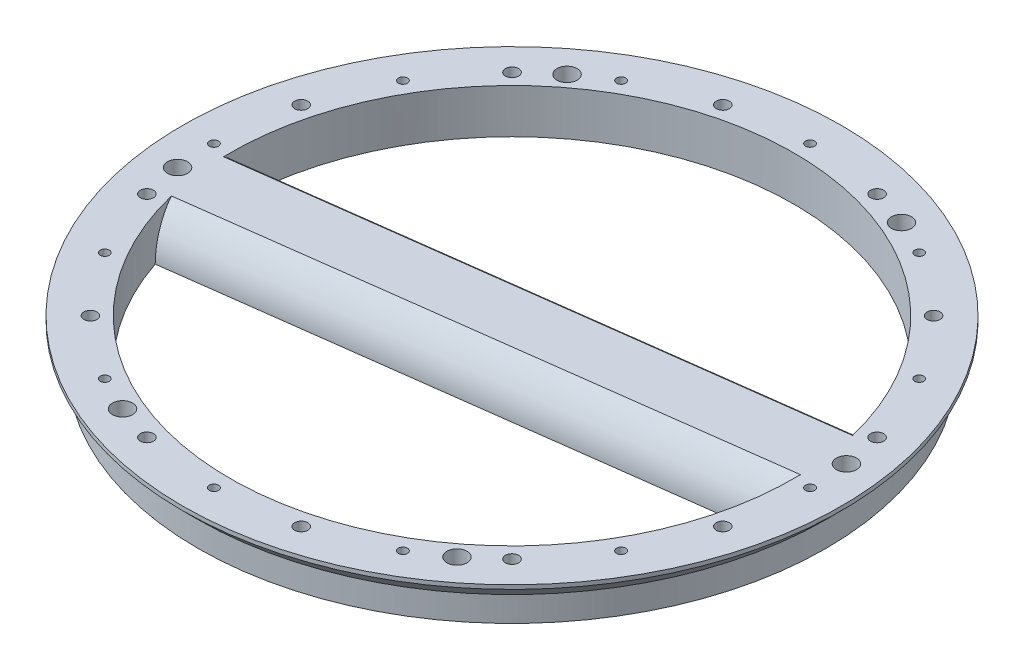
ISO-10303-21;
HEADER;
FILE_DESCRIPTION(('STEP AP214'),'2;1');
FILE_NAME('part.step','',(''),(''),'','','');
FILE_SCHEMA(('AUTOMOTIVE_DESIGN { 1 0 10303 214 1 1 1 1 }'));
ENDSEC;
DATA;
#1=APPLICATION_CONTEXT('core data for automotive mechanical design processes');
#2=APPLICATION_PROTOCOL_DEFINITION('international standard','automotive_design',2000,#1);
#3=PRODUCT_CONTEXT('',#1,'mechanical');
#4=PRODUCT('Part','Part','',(#3));
#5=PRODUCT_RELATED_PRODUCT_CATEGORY('part','',(#4));
#6=PRODUCT_DEFINITION_FORMATION('','',#4);
#7=PRODUCT_DEFINITION_CONTEXT('part definition',#1,'design');
#8=PRODUCT_DEFINITION('design','',#6,#7);
#9=PRODUCT_DEFINITION_SHAPE('','',#8);
#10=(LENGTH_UNIT() NAMED_UNIT(*) SI_UNIT(.MILLI.,.METRE.));
#11=(NAMED_UNIT(*) PLANE_ANGLE_UNIT() SI_UNIT($,.RADIAN.));
#12=(NAMED_UNIT(*) SI_UNIT($,.STERADIAN.) SOLID_ANGLE_UNIT());
#13=UNCERTAINTY_MEASURE_WITH_UNIT(LENGTH_MEASURE(1.E-05),#10,'distance_accuracy_value','');
#14=(GEOMETRIC_REPRESENTATION_CONTEXT(3) GLOBAL_UNCERTAINTY_ASSIGNED_CONTEXT((#13)) GLOBAL_UNIT_ASSIGNED_CONTEXT((#10,
#11,#12)) REPRESENTATION_CONTEXT('',''));
#15=CARTESIAN_POINT('',(0.,0.,0.));
#16=DIRECTION('',(0.,0.,1.));
#17=DIRECTION('',(1.,0.,0.));
#18=AXIS2_PLACEMENT_3D('',#15,#16,#17);
#19=CARTESIAN_POINT('',(0.,0.,0.));
#20=DIRECTION('',(0.,-1.,0.));
#21=DIRECTION('',(0.,0.,-1.));
#22=AXIS2_PLACEMENT_3D('',#19,#20,#21);
#23=CYLINDRICAL_SURFACE('',#22,69.9);
#24=CARTESIAN_POINT('',(0.,11.,0.));
#25=DIRECTION('',(0.,-1.,0.));
#26=DIRECTION('',(0.,0.,-1.));
#27=AXIS2_PLACEMENT_3D('',#24,#25,#26);
#28=CIRCLE('',#27,69.9);
#29=CARTESIAN_POINT('',(69.8808691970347,11.,-1.63527375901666));
#30=VERTEX_POINT('',#29);
#31=CARTESIAN_POINT('',(-67.9229763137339,11.,16.5069466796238));
#32=VERTEX_POINT('',#31);
#33=EDGE_CURVE('E98',#30,#32,#28,.T.);
#34=ORIENTED_EDGE('',*,*,#33,.F.);
#35=CARTESIAN_POINT('',(69.77111202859,0.,4.24286769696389));
#36=CARTESIAN_POINT('',(69.7710865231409,0.370943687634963,4.2429155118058));
#37=CARTESIAN_POINT('',(69.7720697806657,0.741876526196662,4.22710683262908));
#38=CARTESIAN_POINT('',(69.7758690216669,1.48102023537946,4.16412527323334));
#39=CARTESIAN_POINT('',(69.7786847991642,1.84923140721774,4.11695591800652));
#40=CARTESIAN_POINT('',(69.7859567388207,2.57955095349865,3.99173284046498));
#41=CARTESIAN_POINT('',(69.7904094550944,2.94167048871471,3.91374397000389));
#42=CARTESIAN_POINT('',(69.8006027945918,3.65803099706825,3.72754513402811));
#43=CARTESIAN_POINT('',(69.8063434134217,4.01227199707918,3.61933527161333));
#44=CARTESIAN_POINT('',(69.8186541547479,4.71054440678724,3.37352208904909));
#45=CARTESIAN_POINT('',(69.8252246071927,5.05457168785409,3.2359070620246));
#46=CARTESIAN_POINT('',(69.8386290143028,5.729913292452,2.93239834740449));
#47=CARTESIAN_POINT('',(69.8454629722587,6.06122745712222,2.76650430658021));
#48=CARTESIAN_POINT('',(69.8587524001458,6.70896084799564,2.40768231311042));
#49=CARTESIAN_POINT('',(69.8652077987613,7.0253772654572,2.21474928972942));
#50=CARTESIAN_POINT('',(69.8770375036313,7.64112895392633,1.80331963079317));
#51=CARTESIAN_POINT('',(69.8824118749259,7.94046525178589,1.58482453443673));
#52=CARTESIAN_POINT('',(69.8909900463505,8.49707654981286,1.14216153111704));
#53=CARTESIAN_POINT('',(69.8943322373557,8.75580438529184,0.919819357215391));
#54=CARTESIAN_POINT('',(69.8988960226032,9.25566367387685,0.456164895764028));
#55=CARTESIAN_POINT('',(69.900117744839,9.49679618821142,0.214853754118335));
#56=CARTESIAN_POINT('',(69.8998644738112,9.96015478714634,-0.285363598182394));
#57=CARTESIAN_POINT('',(69.89838899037,10.1823774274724,-0.544272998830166));
#58=CARTESIAN_POINT('',(69.8921965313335,10.6066429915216,-1.07813249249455));
#59=CARTESIAN_POINT('',(69.887479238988,10.8086839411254,-1.35308415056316));
#60=CARTESIAN_POINT('',(69.8808691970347,11.,-1.63527375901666));
#61=B_SPLINE_CURVE_WITH_KNOTS('',3,(#35,#36,#37,#38,#39,#40,#41,#42,#43,#44,#45,#46,#47,#48,#49,
#50,#51,#52,#53,#54,#55,#56,#57,#58,#59,#60),.UNSPECIFIED.,.F.,.F.,(4,2,2,2,2,2,2,2,2,2,2,2,4),
(0.,1.11247683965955,2.224828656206,3.33485216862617,4.44487189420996,5.55533437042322,
6.66581071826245,7.77649559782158,8.88711363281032,9.90960803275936,10.9320407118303,
11.9546592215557,12.9773776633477),.UNSPECIFIED.);
#62=CARTESIAN_POINT('',(69.77111202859,0.,4.24286769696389));
#63=VERTEX_POINT('',#62);
#64=EDGE_CURVE('E93',#63,#30,#61,.T.);
#65=ORIENTED_EDGE('',*,*,#64,.F.);
#66=CARTESIAN_POINT('',(0.,0.,0.));
#67=DIRECTION('',(0.,-1.,0.));
#68=DIRECTION('',(0.,0.,-1.));
#69=AXIS2_PLACEMENT_3D('',#66,#67,#68);
#70=CIRCLE('',#69,69.9);
#71=CARTESIAN_POINT('',(-66.2955840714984,0.,22.1563880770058));
#72=VERTEX_POINT('',#71);
#73=EDGE_CURVE('E79',#63,#72,#70,.T.);
#74=ORIENTED_EDGE('',*,*,#73,.T.);
#75=CARTESIAN_POINT('',(-66.2955840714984,0.,22.1563880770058));
#76=CARTESIAN_POINT('',(-66.2955470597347,0.370943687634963,22.1564276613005));
#77=CARTESIAN_POINT('',(-66.3005884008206,0.741876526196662,22.1414121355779));
#78=CARTESIAN_POINT('',(-66.3205590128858,1.48102023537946,22.0815599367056));
#79=CARTESIAN_POINT('',(-66.3354871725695,1.84923140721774,22.0367266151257));
#80=CARTESIAN_POINT('',(-66.374921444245,2.57955095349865,21.9176525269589));
#81=CARTESIAN_POINT('',(-66.3994074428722,2.94167048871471,21.8434735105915));
#82=CARTESIAN_POINT('',(-66.4574452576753,3.65803099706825,21.6662574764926));
#83=CARTESIAN_POINT('',(-66.4909970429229,4.01227199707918,21.5632205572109));
#84=CARTESIAN_POINT('',(-66.5665094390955,4.71054440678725,21.3289695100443));
#85=CARTESIAN_POINT('',(-66.6084733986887,5.0545716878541,21.1977441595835));
#86=CARTESIAN_POINT('',(-66.6999748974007,5.729913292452,20.9080465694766));
#87=CARTESIAN_POINT('',(-66.7495125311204,6.06122745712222,20.7495739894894));
#88=CARTESIAN_POINT('',(-66.8552190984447,6.70896084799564,20.4064181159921));
#89=CARTESIAN_POINT('',(-66.9113892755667,7.02537726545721,20.2217299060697));
#90=CARTESIAN_POINT('',(-67.0293017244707,7.64112895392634,19.8273811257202));
#91=CARTESIAN_POINT('',(-67.0910436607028,7.94046525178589,19.6177220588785));
#92=CARTESIAN_POINT('',(-67.2138991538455,8.49707654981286,19.1923626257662));
#93=CARTESIAN_POINT('',(-67.2746738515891,8.75580438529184,18.9784616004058));
#94=CARTESIAN_POINT('',(-67.3990847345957,9.25566367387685,18.5317869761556));
#95=CARTESIAN_POINT('',(-67.4627207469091,9.49679618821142,18.2990145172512));
#96=CARTESIAN_POINT('',(-67.5919418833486,9.96015478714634,17.8157761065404));
#97=CARTESIAN_POINT('',(-67.6575273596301,10.1823774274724,17.5653069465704));
#98=CARTESIAN_POINT('',(-67.7897189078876,10.6066429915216,17.0480355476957));
#99=CARTESIAN_POINT('',(-67.8563250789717,10.8086839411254,16.7812317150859));
#100=CARTESIAN_POINT('',(-67.9229763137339,11.,16.5069466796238));
#101=B_SPLINE_CURVE_WITH_KNOTS('',3,(#75,#76,#77,#78,#79,#80,#81,#82,#83,#84,#85,#86,#87,#88,
#89,#90,#91,#92,#93,#94,#95,#96,#97,#98,#99,#100),.UNSPECIFIED.,.F.,.F.,(4,2,2,2,2,2,2,2,2,2,2,
2,4),(0.,1.11247683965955,2.224828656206,3.33485216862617,4.44487189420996,5.55533437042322,
6.66581071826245,7.77649559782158,8.88711363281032,9.90960803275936,10.9320407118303,
11.9546592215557,12.9773776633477),.UNSPECIFIED.);
#102=EDGE_CURVE('E86',#72,#32,#101,.T.);
#103=ORIENTED_EDGE('',*,*,#102,.T.);
#104=EDGE_LOOP('',(#34,#65,#74,#103));
#105=FACE_BOUND('',#104,.T.);
#106=ADVANCED_FACE('F36',(#105),#23,.F.);
#107=CARTESIAN_POINT('',(-69.8808691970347,11.,1.63527375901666));
#108=VERTEX_POINT('',#107);
#109=CARTESIAN_POINT('',(67.9229763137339,11.,-16.5069466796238));
#110=VERTEX_POINT('',#109);
#111=EDGE_CURVE('E94',#108,#110,#28,.T.);
#112=ORIENTED_EDGE('',*,*,#111,.F.);
#113=CARTESIAN_POINT('',(-69.8808691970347,11.,1.63527375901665));
#114=CARTESIAN_POINT('',(-69.8881805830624,10.7884581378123,1.32323498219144));
#115=CARTESIAN_POINT('',(-69.8931746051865,10.5637931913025,1.02005404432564));
#116=CARTESIAN_POINT('',(-69.8992687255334,10.0899295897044,0.433489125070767));
#117=CARTESIAN_POINT('',(-69.9003689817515,9.84073193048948,0.150104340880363));
#118=CARTESIAN_POINT('',(-69.8994170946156,9.3196333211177,-0.394671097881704));
#119=CARTESIAN_POINT('',(-69.897366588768,9.04774423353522,-0.656073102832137));
#120=CARTESIAN_POINT('',(-69.8909000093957,8.48302928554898,-1.15514789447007));
#121=CARTESIAN_POINT('',(-69.8864839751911,8.19020377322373,-1.39282107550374));
#122=CARTESIAN_POINT('',(-69.8760654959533,7.58533935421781,-1.84288061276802));
#123=CARTESIAN_POINT('',(-69.8700616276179,7.27328340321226,-2.05524403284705));
#124=CARTESIAN_POINT('',(-69.8572348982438,6.63234472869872,-2.45281603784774));
#125=CARTESIAN_POINT('',(-69.8504120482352,6.3034622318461,-2.63802498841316));
#126=CARTESIAN_POINT('',(-69.8366697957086,5.63136898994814,-2.97972953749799));
#127=CARTESIAN_POINT('',(-69.8297504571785,5.28816746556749,-3.13624327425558));
#128=CARTESIAN_POINT('',(-69.8164567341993,4.5896779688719,-3.41942732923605));
#129=CARTESIAN_POINT('',(-69.8100822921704,4.23439127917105,-3.54610080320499));
#130=CARTESIAN_POINT('',(-69.7991885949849,3.56137957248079,-3.75401551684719));
#131=CARTESIAN_POINT('',(-69.7945357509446,3.24481656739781,-3.83903132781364));
#132=CARTESIAN_POINT('',(-69.7863425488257,2.60623496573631,-3.9851883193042));
#133=CARTESIAN_POINT('',(-69.7828020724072,2.28421695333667,-4.04633203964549));
#134=CARTESIAN_POINT('',(-69.7770486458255,1.63612555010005,-4.14439856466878));
#135=CARTESIAN_POINT('',(-69.7748372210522,1.31004793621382,-4.18129354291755));
#136=CARTESIAN_POINT('',(-69.7718609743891,0.65598281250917,-4.23054470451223));
#137=CARTESIAN_POINT('',(-69.7710964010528,0.327994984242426,-4.24289667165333));
#138=CARTESIAN_POINT('',(-69.77111202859,0.,-4.24286769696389));
#139=B_SPLINE_CURVE_WITH_KNOTS('',3,(#113,#114,#115,#116,#117,#118,#119,#120,#121,#122,#123,
#124,#125,#126,#127,#128,#129,#130,#131,#132,#133,#134,#135,#136,#137,#138),.UNSPECIFIED.,.F.,
.F.,(4,2,2,2,2,2,2,2,2,2,2,2,4),(0.,1.13081597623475,2.26158606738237,3.39176867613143,
4.52193249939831,5.65311283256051,6.78427793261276,7.91472553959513,9.04505354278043,
10.0276039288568,11.0100497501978,11.9936210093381,12.9773612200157),.UNSPECIFIED.);
#140=CARTESIAN_POINT('',(-69.77111202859,0.,-4.24286769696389));
#141=VERTEX_POINT('',#140);
#142=EDGE_CURVE('E91',#108,#141,#139,.T.);
#143=ORIENTED_EDGE('',*,*,#142,.T.);
#144=CARTESIAN_POINT('',(66.2955840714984,0.,-22.1563880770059));
#145=VERTEX_POINT('',#144);
#146=EDGE_CURVE('E95',#141,#145,#70,.T.);
#147=ORIENTED_EDGE('',*,*,#146,.T.);
#148=CARTESIAN_POINT('',(67.9229763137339,11.,-16.5069466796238));
#149=CARTESIAN_POINT('',(67.8492769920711,10.7884581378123,-16.810245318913));
#150=CARTESIAN_POINT('',(67.7756318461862,10.5637931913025,-17.1043881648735));
#151=CARTESIAN_POINT('',(67.6297041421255,10.0899295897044,-17.6725436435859));
#152=CARTESIAN_POINT('',(67.5574215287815,9.84073193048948,-17.9465570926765));
#153=CARTESIAN_POINT('',(67.4155038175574,9.3196333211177,-18.4725233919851));
#154=CARTESIAN_POINT('',(67.3458673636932,9.04774423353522,-18.7244876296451));
#155=CARTESIAN_POINT('',(67.2104510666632,8.48302928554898,-19.2048831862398));
#156=CARTESIAN_POINT('',(67.1446711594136,8.19020377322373,-19.4333148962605));
#157=CARTESIAN_POINT('',(67.0181237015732,7.5853393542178,-19.865342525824));
#158=CARTESIAN_POINT('',(66.9573607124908,7.27328340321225,-20.0689159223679));
#159=CARTESIAN_POINT('',(66.8420718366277,6.63234472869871,-20.4496211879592));
#160=CARTESIAN_POINT('',(66.7875458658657,6.30346223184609,-20.6267534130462));
#161=CARTESIAN_POINT('',(66.6858322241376,5.63136898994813,-20.9532579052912));
#162=CARTESIAN_POINT('',(66.6386399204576,5.28816746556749,-21.1026477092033));
#163=CARTESIAN_POINT('',(66.5525057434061,4.58967796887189,-21.3727418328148));
#164=CARTESIAN_POINT('',(66.5135629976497,4.23439127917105,-21.4934491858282));
#165=CARTESIAN_POINT('',(66.4492282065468,3.56137957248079,-21.6914598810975));
#166=CARTESIAN_POINT('',(66.4227301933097,3.24481656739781,-21.7723746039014));
#167=CARTESIAN_POINT('',(66.3769879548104,2.60623496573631,-21.9114308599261));
#168=CARTESIAN_POINT('',(66.3577429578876,2.28421695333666,-21.9695748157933));
#169=CARTESIAN_POINT('',(66.3268040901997,1.63612555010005,-22.0628107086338));
#170=CARTESIAN_POINT('',(66.3151188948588,1.31004793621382,-22.0978761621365));
#171=CARTESIAN_POINT('',(66.2994969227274,0.655982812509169,-22.1446788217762));
#172=CARTESIAN_POINT('',(66.2955614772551,0.327994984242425,-22.1564120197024));
#173=CARTESIAN_POINT('',(66.2955840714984,0.,-22.1563880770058));
#174=B_SPLINE_CURVE_WITH_KNOTS('',3,(#148,#149,#150,#151,#152,#153,#154,#155,#156,#157,#158,
#159,#160,#161,#162,#163,#164,#165,#166,#167,#168,#169,#170,#171,#172,#173),.UNSPECIFIED.,.F.,
.F.,(4,2,2,2,2,2,2,2,2,2,2,2,4),(0.,1.13081597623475,2.26158606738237,3.39176867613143,
4.52193249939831,5.65311283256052,6.78427793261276,7.91472553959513,9.04505354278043,
10.0276039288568,11.0100497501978,11.9936210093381,12.9773612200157),.UNSPECIFIED.);
#175=EDGE_CURVE('E273',#110,#145,#174,.T.);
#176=ORIENTED_EDGE('',*,*,#175,.F.);
#177=EDGE_LOOP('',(#112,#143,#147,#176));
#178=FACE_BOUND('',#177,.T.);
#179=ADVANCED_FACE('F129',(#178),#23,.F.);
#180=CARTESIAN_POINT('',(69.9,0.,0.));
#181=DIRECTION('',(0.,-1.,0.));
#182=DIRECTION('',(0.,0.,-1.));
#183=AXIS2_PLACEMENT_3D('',#180,#181,#182);
#184=PLANE('',#183);
#185=ORIENTED_EDGE('',*,*,#73,.F.);
#186=DIRECTION('',(-0.99144486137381,0.,0.130526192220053));
#187=VECTOR('',#186,1.);
#188=CARTESIAN_POINT('',(101.852395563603,0.,0.0192865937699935));
#189=LINE('',#188,#187);
#190=EDGE_CURVE('E75',#63,#72,#189,.T.);
#191=ORIENTED_EDGE('',*,*,#190,.T.);
#192=EDGE_LOOP('',(#185,#191));
#193=FACE_BOUND('',#192,.T.);
#194=CARTESIAN_POINT('',(73.2677752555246,0.,-9.64588560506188));
#195=DIRECTION('',(0.,-1.,0.));
#196=DIRECTION('',(0.,0.,-1.));
#197=AXIS2_PLACEMENT_3D('',#194,#195,#196);
#198=CIRCLE('',#197,2.5);
#199=CARTESIAN_POINT('',(73.2677752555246,0.,-12.1458856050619));
#200=VERTEX_POINT('',#199);
#201=EDGE_CURVE('E275',#200,#200,#198,.T.);
#202=ORIENTED_EDGE('',*,*,#201,.F.);
#203=EDGE_LOOP('',(#202));
#204=FACE_BOUND('',#203,.T.);
#205=CARTESIAN_POINT('',(44.9874696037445,0.,58.6288118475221));
#206=DIRECTION('',(0.,-1.,0.));
#207=DIRECTION('',(0.,0.,-1.));
#208=AXIS2_PLACEMENT_3D('',#205,#206,#207);
#209=CIRCLE('',#208,2.5);
#210=CARTESIAN_POINT('',(44.9874696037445,0.,56.1288118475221));
#211=VERTEX_POINT('',#210);
#212=EDGE_CURVE('E829',#211,#211,#209,.T.);
#213=ORIENTED_EDGE('',*,*,#212,.F.);
#214=EDGE_LOOP('',(#213));
#215=FACE_BOUND('',#214,.T.);
#216=CARTESIAN_POINT('',(-28.28030565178,0.,68.2746974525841));
#217=DIRECTION('',(0.,-1.,0.));
#218=DIRECTION('',(0.,0.,-1.));
#219=AXIS2_PLACEMENT_3D('',#216,#217,#218);
#220=CIRCLE('',#219,2.5);
#221=CARTESIAN_POINT('',(-28.28030565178,0.,65.7746974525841));
#222=VERTEX_POINT('',#221);
#223=EDGE_CURVE('E825',#222,#222,#220,.T.);
#224=ORIENTED_EDGE('',*,*,#223,.F.);
#225=EDGE_LOOP('',(#224));
#226=FACE_BOUND('',#225,.T.);
#227=CARTESIAN_POINT('',(-73.2677752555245,0.,9.64588560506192));
#228=DIRECTION('',(0.,-1.,0.));
#229=DIRECTION('',(0.,0.,-1.));
#230=AXIS2_PLACEMENT_3D('',#227,#228,#229);
#231=CIRCLE('',#230,2.5);
#232=CARTESIAN_POINT('',(-73.2677752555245,0.,7.14588560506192));
#233=VERTEX_POINT('',#232);
#234=EDGE_CURVE('E821',#233,#233,#231,.T.);
#235=ORIENTED_EDGE('',*,*,#234,.F.);
#236=EDGE_LOOP('',(#235));
#237=FACE_BOUND('',#236,.T.);
#238=CARTESIAN_POINT('',(-44.9874696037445,0.,-58.6288118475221));
#239=DIRECTION('',(0.,-1.,0.));
#240=DIRECTION('',(0.,0.,-1.));
#241=AXIS2_PLACEMENT_3D('',#238,#239,#240);
#242=CIRCLE('',#241,2.5);
#243=CARTESIAN_POINT('',(-44.9874696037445,0.,-61.1288118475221));
#244=VERTEX_POINT('',#243);
#245=EDGE_CURVE('E817',#244,#244,#242,.T.);
#246=ORIENTED_EDGE('',*,*,#245,.F.);
#247=EDGE_LOOP('',(#246));
#248=FACE_BOUND('',#247,.T.);
#249=CARTESIAN_POINT('',(28.28030565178,0.,-68.274697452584));
#250=DIRECTION('',(0.,-1.,0.));
#251=DIRECTION('',(0.,0.,-1.));
#252=AXIS2_PLACEMENT_3D('',#249,#250,#251);
#253=CIRCLE('',#252,2.5);
#254=CARTESIAN_POINT('',(28.28030565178,0.,-70.774697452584));
#255=VERTEX_POINT('',#254);
#256=EDGE_CURVE('E813',#255,#255,#253,.T.);
#257=ORIENTED_EDGE('',*,*,#256,.F.);
#258=EDGE_LOOP('',(#257));
#259=FACE_BOUND('',#258,.T.);
#260=CARTESIAN_POINT('',(71.3819185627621,0.,-19.1267274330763));
#261=DIRECTION('',(0.,-1.,0.));
#262=DIRECTION('',(0.,0.,-1.));
#263=AXIS2_PLACEMENT_3D('',#260,#261,#262);
#264=CIRCLE('',#263,1.63194999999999);
#265=CARTESIAN_POINT('',(71.3819185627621,0.,-20.7586774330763));
#266=VERTEX_POINT('',#265);
#267=EDGE_CURVE('E809',#266,#266,#264,.T.);
#268=ORIENTED_EDGE('',*,*,#267,.F.);
#269=EDGE_LOOP('',(#268));
#270=FACE_BOUND('',#269,.T.);
#271=CARTESIAN_POINT('',(71.3819185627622,0.,19.1267274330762));
#272=DIRECTION('',(0.,-1.,0.));
#273=DIRECTION('',(0.,0.,-1.));
#274=AXIS2_PLACEMENT_3D('',#271,#272,#273);
#275=CIRCLE('',#274,1.63194999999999);
#276=CARTESIAN_POINT('',(71.3819185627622,0.,17.4947774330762));
#277=VERTEX_POINT('',#276);
#278=EDGE_CURVE('E805',#277,#277,#275,.T.);
#279=ORIENTED_EDGE('',*,*,#278,.F.);
#280=EDGE_LOOP('',(#279));
#281=FACE_BOUND('',#280,.T.);
#282=CARTESIAN_POINT('',(52.255191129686,0.,52.2551911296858));
#283=DIRECTION('',(0.,-1.,0.));
#284=DIRECTION('',(0.,0.,-1.));
#285=AXIS2_PLACEMENT_3D('',#282,#283,#284);
#286=CIRCLE('',#285,1.63195);
#287=CARTESIAN_POINT('',(52.255191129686,0.,50.6232411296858));
#288=VERTEX_POINT('',#287);
#289=EDGE_CURVE('E801',#288,#288,#286,.T.);
#290=ORIENTED_EDGE('',*,*,#289,.F.);
#291=EDGE_LOOP('',(#290));
#292=FACE_BOUND('',#291,.T.);
#293=CARTESIAN_POINT('',(19.1267274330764,0.,71.3819185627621));
#294=DIRECTION('',(0.,-1.,0.));
#295=DIRECTION('',(0.,0.,-1.));
#296=AXIS2_PLACEMENT_3D('',#293,#294,#295);
#297=CIRCLE('',#296,1.63195);
#298=CARTESIAN_POINT('',(19.1267274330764,0.,69.7499685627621));
#299=VERTEX_POINT('',#298);
#300=EDGE_CURVE('E797',#299,#299,#297,.T.);
#301=ORIENTED_EDGE('',*,*,#300,.F.);
#302=EDGE_LOOP('',(#301));
#303=FACE_BOUND('',#302,.T.);
#304=CARTESIAN_POINT('',(-19.1267274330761,0.,71.3819185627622));
#305=DIRECTION('',(0.,-1.,0.));
#306=DIRECTION('',(0.,0.,-1.));
#307=AXIS2_PLACEMENT_3D('',#304,#305,#306);
#308=CIRCLE('',#307,1.63195);
#309=CARTESIAN_POINT('',(-19.1267274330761,0.,69.7499685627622));
#310=VERTEX_POINT('',#309);
#311=EDGE_CURVE('E793',#310,#310,#308,.T.);
#312=ORIENTED_EDGE('',*,*,#311,.F.);
#313=EDGE_LOOP('',(#312));
#314=FACE_BOUND('',#313,.T.);
#315=CARTESIAN_POINT('',(-52.2551911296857,0.,52.255191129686));
#316=DIRECTION('',(0.,-1.,0.));
#317=DIRECTION('',(0.,0.,-1.));
#318=AXIS2_PLACEMENT_3D('',#315,#316,#317);
#319=CIRCLE('',#318,1.63195);
#320=CARTESIAN_POINT('',(-52.2551911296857,0.,50.623241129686));
#321=VERTEX_POINT('',#320);
#322=EDGE_CURVE('E789',#321,#321,#319,.T.);
#323=ORIENTED_EDGE('',*,*,#322,.F.);
#324=EDGE_LOOP('',(#323));
#325=FACE_BOUND('',#324,.T.);
#326=CARTESIAN_POINT('',(-71.381918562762,0.,19.1267274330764));
#327=DIRECTION('',(0.,-1.,0.));
#328=DIRECTION('',(0.,0.,-1.));
#329=AXIS2_PLACEMENT_3D('',#326,#327,#328);
#330=CIRCLE('',#329,1.63194999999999);
#331=CARTESIAN_POINT('',(-71.381918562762,0.,17.4947774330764));
#332=VERTEX_POINT('',#331);
#333=EDGE_CURVE('E785',#332,#332,#330,.T.);
#334=ORIENTED_EDGE('',*,*,#333,.F.);
#335=EDGE_LOOP('',(#334));
#336=FACE_BOUND('',#335,.T.);
#337=CARTESIAN_POINT('',(-71.3819185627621,0.,-19.1267274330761));
#338=DIRECTION('',(0.,-1.,0.));
#339=DIRECTION('',(0.,0.,-1.));
#340=AXIS2_PLACEMENT_3D('',#337,#338,#339);
#341=CIRCLE('',#340,1.63194999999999);
#342=CARTESIAN_POINT('',(-71.3819185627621,0.,-20.7586774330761));
#343=VERTEX_POINT('',#342);
#344=EDGE_CURVE('E781',#343,#343,#341,.T.);
#345=ORIENTED_EDGE('',*,*,#344,.F.);
#346=EDGE_LOOP('',(#345));
#347=FACE_BOUND('',#346,.T.);
#348=CARTESIAN_POINT('',(-52.2551911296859,0.,-52.2551911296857));
#349=DIRECTION('',(0.,-1.,0.));
#350=DIRECTION('',(0.,0.,-1.));
#351=AXIS2_PLACEMENT_3D('',#348,#349,#350);
#352=CIRCLE('',#351,1.63195);
#353=CARTESIAN_POINT('',(-52.2551911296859,0.,-53.8871411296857));
#354=VERTEX_POINT('',#353);
#355=EDGE_CURVE('E777',#354,#354,#352,.T.);
#356=ORIENTED_EDGE('',*,*,#355,.F.);
#357=EDGE_LOOP('',(#356));
#358=FACE_BOUND('',#357,.T.);
#359=CARTESIAN_POINT('',(-19.1267274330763,0.,-71.3819185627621));
#360=DIRECTION('',(0.,-1.,0.));
#361=DIRECTION('',(0.,0.,-1.));
#362=AXIS2_PLACEMENT_3D('',#359,#360,#361);
#363=CIRCLE('',#362,1.63195);
#364=CARTESIAN_POINT('',(-19.1267274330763,0.,-73.0138685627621));
#365=VERTEX_POINT('',#364);
#366=EDGE_CURVE('E773',#365,#365,#363,.T.);
#367=ORIENTED_EDGE('',*,*,#366,.F.);
#368=EDGE_LOOP('',(#367));
#369=FACE_BOUND('',#368,.T.);
#370=CARTESIAN_POINT('',(19.1267274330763,0.,-71.3819185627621));
#371=DIRECTION('',(0.,-1.,0.));
#372=DIRECTION('',(0.,0.,-1.));
#373=AXIS2_PLACEMENT_3D('',#370,#371,#372);
#374=CIRCLE('',#373,1.63195);
#375=CARTESIAN_POINT('',(19.1267274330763,0.,-73.0138685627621));
#376=VERTEX_POINT('',#375);
#377=EDGE_CURVE('E769',#376,#376,#374,.T.);
#378=ORIENTED_EDGE('',*,*,#377,.F.);
#379=EDGE_LOOP('',(#378));
#380=FACE_BOUND('',#379,.T.);
#381=CARTESIAN_POINT('',(52.2551911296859,0.,-52.2551911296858));
#382=DIRECTION('',(0.,-1.,0.));
#383=DIRECTION('',(0.,0.,-1.));
#384=AXIS2_PLACEMENT_3D('',#381,#382,#383);
#385=CIRCLE('',#384,1.63195);
#386=CARTESIAN_POINT('',(52.2551911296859,0.,-53.8871411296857));
#387=VERTEX_POINT('',#386);
#388=EDGE_CURVE('E765',#387,#387,#385,.T.);
#389=ORIENTED_EDGE('',*,*,#388,.F.);
#390=EDGE_LOOP('',(#389));
#391=FACE_BOUND('',#390,.T.);
#392=CARTESIAN_POINT('',(73.9,0.,0.));
#393=DIRECTION('',(0.,-1.,0.));
#394=DIRECTION('',(0.,0.,-1.));
#395=AXIS2_PLACEMENT_3D('',#392,#393,#394);
#396=CIRCLE('',#395,1.13029999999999);
#397=CARTESIAN_POINT('',(73.9,0.,-1.13029999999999));
#398=VERTEX_POINT('',#397);
#399=EDGE_CURVE('E761',#398,#398,#396,.T.);
#400=ORIENTED_EDGE('',*,*,#399,.F.);
#401=EDGE_LOOP('',(#400));
#402=FACE_BOUND('',#401,.T.);
#403=CARTESIAN_POINT('',(63.9992773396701,0.,36.95));
#404=DIRECTION('',(0.,-1.,0.));
#405=DIRECTION('',(0.,0.,-1.));
#406=AXIS2_PLACEMENT_3D('',#403,#404,#405);
#407=CIRCLE('',#406,1.13029999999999);
#408=CARTESIAN_POINT('',(63.9992773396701,0.,35.8197));
#409=VERTEX_POINT('',#408);
#410=EDGE_CURVE('E757',#409,#409,#407,.T.);
#411=ORIENTED_EDGE('',*,*,#410,.F.);
#412=EDGE_LOOP('',(#411));
#413=FACE_BOUND('',#412,.T.);
#414=CARTESIAN_POINT('',(36.95,0.,63.99927733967));
#415=DIRECTION('',(0.,-1.,0.));
#416=DIRECTION('',(0.,0.,-1.));
#417=AXIS2_PLACEMENT_3D('',#414,#415,#416);
#418=CIRCLE('',#417,1.13029999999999);
#419=CARTESIAN_POINT('',(36.95,0.,62.86897733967));
#420=VERTEX_POINT('',#419);
#421=EDGE_CURVE('E753',#420,#420,#418,.T.);
#422=ORIENTED_EDGE('',*,*,#421,.F.);
#423=EDGE_LOOP('',(#422));
#424=FACE_BOUND('',#423,.T.);
#425=CARTESIAN_POINT('',(0.,0.,73.9));
#426=DIRECTION('',(0.,-1.,0.));
#427=DIRECTION('',(0.,0.,-1.));
#428=AXIS2_PLACEMENT_3D('',#425,#426,#427);
#429=CIRCLE('',#428,1.13029999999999);
#430=CARTESIAN_POINT('',(0.,0.,72.7697));
#431=VERTEX_POINT('',#430);
#432=EDGE_CURVE('E749',#431,#431,#429,.T.);
#433=ORIENTED_EDGE('',*,*,#432,.F.);
#434=EDGE_LOOP('',(#433));
#435=FACE_BOUND('',#434,.T.);
#436=CARTESIAN_POINT('',(-36.9499999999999,0.,63.9992773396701));
#437=DIRECTION('',(0.,-1.,0.));
#438=DIRECTION('',(0.,0.,-1.));
#439=AXIS2_PLACEMENT_3D('',#436,#437,#438);
#440=CIRCLE('',#439,1.13029999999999);
#441=CARTESIAN_POINT('',(-36.9499999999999,0.,62.8689773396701));
#442=VERTEX_POINT('',#441);
#443=EDGE_CURVE('E745',#442,#442,#440,.T.);
#444=ORIENTED_EDGE('',*,*,#443,.F.);
#445=EDGE_LOOP('',(#444));
#446=FACE_BOUND('',#445,.T.);
#447=CARTESIAN_POINT('',(-63.99927733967,0.,36.9500000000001));
#448=DIRECTION('',(0.,-1.,0.));
#449=DIRECTION('',(0.,0.,-1.));
#450=AXIS2_PLACEMENT_3D('',#447,#448,#449);
#451=CIRCLE('',#450,1.13029999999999);
#452=CARTESIAN_POINT('',(-63.99927733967,0.,35.8197000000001));
#453=VERTEX_POINT('',#452);
#454=EDGE_CURVE('E741',#453,#453,#451,.T.);
#455=ORIENTED_EDGE('',*,*,#454,.F.);
#456=EDGE_LOOP('',(#455));
#457=FACE_BOUND('',#456,.T.);
#458=CARTESIAN_POINT('',(-73.9,0.,0.));
#459=DIRECTION('',(0.,-1.,0.));
#460=DIRECTION('',(0.,0.,-1.));
#461=AXIS2_PLACEMENT_3D('',#458,#459,#460);
#462=CIRCLE('',#461,1.13029999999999);
#463=CARTESIAN_POINT('',(-73.9,0.,-1.1302999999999));
#464=VERTEX_POINT('',#463);
#465=EDGE_CURVE('E737',#464,#464,#462,.T.);
#466=ORIENTED_EDGE('',*,*,#465,.F.);
#467=EDGE_LOOP('',(#466));
#468=FACE_BOUND('',#467,.T.);
#469=CARTESIAN_POINT('',(-63.99927733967,0.,-36.9499999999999));
#470=DIRECTION('',(0.,-1.,0.));
#471=DIRECTION('',(0.,0.,-1.));
#472=AXIS2_PLACEMENT_3D('',#469,#470,#471);
#473=CIRCLE('',#472,1.13029999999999);
#474=CARTESIAN_POINT('',(-63.99927733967,0.,-38.0802999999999));
#475=VERTEX_POINT('',#474);
#476=EDGE_CURVE('E733',#475,#475,#473,.T.);
#477=ORIENTED_EDGE('',*,*,#476,.F.);
#478=EDGE_LOOP('',(#477));
#479=FACE_BOUND('',#478,.T.);
#480=CARTESIAN_POINT('',(-36.95,0.,-63.9992773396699));
#481=DIRECTION('',(0.,-1.,0.));
#482=DIRECTION('',(0.,0.,-1.));
#483=AXIS2_PLACEMENT_3D('',#480,#481,#482);
#484=CIRCLE('',#483,1.13029999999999);
#485=CARTESIAN_POINT('',(-36.95,0.,-65.1295773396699));
#486=VERTEX_POINT('',#485);
#487=EDGE_CURVE('E729',#486,#486,#484,.T.);
#488=ORIENTED_EDGE('',*,*,#487,.F.);
#489=EDGE_LOOP('',(#488));
#490=FACE_BOUND('',#489,.T.);
#491=CARTESIAN_POINT('',(0.,0.,-73.8999999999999));
#492=DIRECTION('',(0.,-1.,0.));
#493=DIRECTION('',(0.,0.,-1.));
#494=AXIS2_PLACEMENT_3D('',#491,#492,#493);
#495=CIRCLE('',#494,1.13029999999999);
#496=CARTESIAN_POINT('',(0.,0.,-75.0302999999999));
#497=VERTEX_POINT('',#496);
#498=EDGE_CURVE('E426',#497,#497,#495,.T.);
#499=ORIENTED_EDGE('',*,*,#498,.F.);
#500=EDGE_LOOP('',(#499));
#501=FACE_BOUND('',#500,.T.);
#502=CARTESIAN_POINT('',(36.9499999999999,0.,-63.99927733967));
#503=DIRECTION('',(0.,-1.,0.));
#504=DIRECTION('',(0.,0.,-1.));
#505=AXIS2_PLACEMENT_3D('',#502,#503,#504);
#506=CIRCLE('',#505,1.13029999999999);
#507=CARTESIAN_POINT('',(36.9499999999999,0.,-65.12957733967));
#508=VERTEX_POINT('',#507);
#509=EDGE_CURVE('E425',#508,#508,#506,.T.);
#510=ORIENTED_EDGE('',*,*,#509,.F.);
#511=EDGE_LOOP('',(#510));
#512=FACE_BOUND('',#511,.T.);
#513=CARTESIAN_POINT('',(63.99927733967,0.,-36.95));
#514=DIRECTION('',(0.,-1.,0.));
#515=DIRECTION('',(0.,0.,-1.));
#516=AXIS2_PLACEMENT_3D('',#513,#514,#515);
#517=CIRCLE('',#516,1.13029999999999);
#518=CARTESIAN_POINT('',(63.99927733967,0.,-38.0803));
#519=VERTEX_POINT('',#518);
#520=EDGE_CURVE('E101',#519,#519,#517,.T.);
#521=ORIENTED_EDGE('',*,*,#520,.F.);
#522=EDGE_LOOP('',(#521));
#523=FACE_BOUND('',#522,.T.);
#524=CARTESIAN_POINT('',(0.,0.,0.));
#525=DIRECTION('',(0.,-1.,0.));
#526=DIRECTION('',(0.,0.,-1.));
#527=AXIS2_PLACEMENT_3D('',#524,#525,#526);
#528=CIRCLE('',#527,77.9);
#529=CARTESIAN_POINT('',(0.,0.,-77.9));
#530=VERTEX_POINT('',#529);
#531=EDGE_CURVE('E11',#530,#530,#528,.T.);
#532=ORIENTED_EDGE('',*,*,#531,.T.);
#533=EDGE_LOOP('',(#532));
#534=FACE_BOUND('',#533,.T.);
#535=DIRECTION('',(-0.99144486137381,0.,0.130526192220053));
#536=VECTOR('',#535,1.);
#537=CARTESIAN_POINT('',(98.3768676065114,0.,-26.3799691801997));
#538=LINE('',#537,#536);
#539=EDGE_CURVE('E56',#145,#141,#538,.T.);
#540=ORIENTED_EDGE('',*,*,#539,.F.);
#541=ORIENTED_EDGE('',*,*,#146,.F.);
#542=EDGE_LOOP('',(#540,#541));
#543=FACE_BOUND('',#542,.T.);
#544=ADVANCED_FACE('F38',(#193,#204,#215,#226,#237,#248,#259,#270,#281,#292,#303,#314,#325,#336,
#347,#358,#369,#380,#391,#402,#413,#424,#435,#446,#457,#468,#479,#490,#501,#512,#523,#534,#543),
#184,.T.);
#545=CARTESIAN_POINT('',(0.,0.,0.));
#546=DIRECTION('',(0.,-1.,0.));
#547=DIRECTION('',(0.,0.,-1.));
#548=AXIS2_PLACEMENT_3D('',#545,#546,#547);
#549=CYLINDRICAL_SURFACE('',#548,77.9);
#550=CARTESIAN_POINT('',(0.,6.20000000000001,0.));
#551=DIRECTION('',(0.,-1.,0.));
#552=DIRECTION('',(0.,0.,-1.));
#553=AXIS2_PLACEMENT_3D('',#550,#551,#552);
#554=CIRCLE('',#553,77.9);
#555=CARTESIAN_POINT('',(0.,6.20000000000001,-77.9));
#556=VERTEX_POINT('',#555);
#557=EDGE_CURVE('E44',#556,#556,#554,.T.);
#558=ORIENTED_EDGE('',*,*,#557,.T.);
#559=EDGE_LOOP('',(#558));
#560=FACE_BOUND('',#559,.T.);
#561=ORIENTED_EDGE('',*,*,#531,.F.);
#562=EDGE_LOOP('',(#561));
#563=FACE_BOUND('',#562,.T.);
#564=ADVANCED_FACE('F113',(#560,#563),#549,.T.);
#565=CARTESIAN_POINT('',(0.,6.20000000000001,0.));
#566=DIRECTION('',(0.,1.,0.));
#567=DIRECTION('',(0.,0.,1.));
#568=AXIS2_PLACEMENT_3D('',#565,#566,#567);
#569=CONICAL_SURFACE('',#568,77.9,0.78539816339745);
#570=CARTESIAN_POINT('',(0.,10.,0.));
#571=DIRECTION('',(0.,-1.,0.));
#572=DIRECTION('',(0.,0.,-1.));
#573=AXIS2_PLACEMENT_3D('',#570,#571,#572);
#574=CIRCLE('',#573,81.7);
#575=CARTESIAN_POINT('',(0.,10.,-81.7));
#576=VERTEX_POINT('',#575);
#577=EDGE_CURVE('E108',#576,#576,#574,.T.);
#578=ORIENTED_EDGE('',*,*,#577,.T.);
#579=EDGE_LOOP('',(#578));
#580=FACE_BOUND('',#579,.T.);
#581=ORIENTED_EDGE('',*,*,#557,.F.);
#582=EDGE_LOOP('',(#581));
#583=FACE_BOUND('',#582,.T.);
#584=ADVANCED_FACE('F116',(#580,#583),#569,.T.);
#585=CARTESIAN_POINT('',(0.,0.,0.));
#586=DIRECTION('',(0.,-1.,0.));
#587=DIRECTION('',(0.,0.,-1.));
#588=AXIS2_PLACEMENT_3D('',#585,#586,#587);
#589=CYLINDRICAL_SURFACE('',#588,81.7);
#590=CARTESIAN_POINT('',(0.,11.,0.));
#591=DIRECTION('',(0.,-1.,0.));
#592=DIRECTION('',(0.,0.,-1.));
#593=AXIS2_PLACEMENT_3D('',#590,#591,#592);
#594=CIRCLE('',#593,81.7);
#595=CARTESIAN_POINT('',(0.,11.,-81.7));
#596=VERTEX_POINT('',#595);
#597=EDGE_CURVE('E105',#596,#596,#594,.T.);
#598=ORIENTED_EDGE('',*,*,#597,.T.);
#599=EDGE_LOOP('',(#598));
#600=FACE_BOUND('',#599,.T.);
#601=ORIENTED_EDGE('',*,*,#577,.F.);
#602=EDGE_LOOP('',(#601));
#603=FACE_BOUND('',#602,.T.);
#604=ADVANCED_FACE('F118',(#600,#603),#589,.T.);
#605=CARTESIAN_POINT('',(81.7,11.,0.));
#606=DIRECTION('',(0.,1.,0.));
#607=DIRECTION('',(0.,0.,1.));
#608=AXIS2_PLACEMENT_3D('',#605,#606,#607);
#609=PLANE('',#608);
#610=DIRECTION('',(-0.99144486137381,0.,0.130526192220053));
#611=VECTOR('',#610,1.);
#612=CARTESIAN_POINT('',(101.093578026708,11.,-5.7445048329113));
#613=LINE('',#612,#611);
#614=EDGE_CURVE('E83',#30,#32,#613,.T.);
#615=ORIENTED_EDGE('',*,*,#614,.F.);
#616=ORIENTED_EDGE('',*,*,#33,.T.);
#617=EDGE_LOOP('',(#615,#616));
#618=FACE_BOUND('',#617,.T.);
#619=CARTESIAN_POINT('',(73.2677752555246,11.,-9.64588560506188));
#620=DIRECTION('',(0.,1.,0.));
#621=DIRECTION('',(0.,0.,1.));
#622=AXIS2_PLACEMENT_3D('',#619,#620,#621);
#623=CIRCLE('',#622,2.5);
#624=CARTESIAN_POINT('',(73.2677752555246,11.,-7.14588560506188));
#625=VERTEX_POINT('',#624);
#626=EDGE_CURVE('E150',#625,#625,#623,.T.);
#627=ORIENTED_EDGE('',*,*,#626,.F.);
#628=EDGE_LOOP('',(#627));
#629=FACE_BOUND('',#628,.T.);
#630=CARTESIAN_POINT('',(44.9874696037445,11.,58.6288118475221));
#631=DIRECTION('',(0.,1.,0.));
#632=DIRECTION('',(0.,0.,1.));
#633=AXIS2_PLACEMENT_3D('',#630,#631,#632);
#634=CIRCLE('',#633,2.5);
#635=CARTESIAN_POINT('',(44.9874696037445,11.,61.1288118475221));
#636=VERTEX_POINT('',#635);
#637=EDGE_CURVE('E154',#636,#636,#634,.T.);
#638=ORIENTED_EDGE('',*,*,#637,.F.);
#639=EDGE_LOOP('',(#638));
#640=FACE_BOUND('',#639,.T.);
#641=CARTESIAN_POINT('',(-28.28030565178,11.,68.2746974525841));
#642=DIRECTION('',(0.,1.,0.));
#643=DIRECTION('',(0.,0.,1.));
#644=AXIS2_PLACEMENT_3D('',#641,#642,#643);
#645=CIRCLE('',#644,2.5);
#646=CARTESIAN_POINT('',(-28.28030565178,11.,70.7746974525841));
#647=VERTEX_POINT('',#646);
#648=EDGE_CURVE('E158',#647,#647,#645,.T.);
#649=ORIENTED_EDGE('',*,*,#648,.F.);
#650=EDGE_LOOP('',(#649));
#651=FACE_BOUND('',#650,.T.);
#652=CARTESIAN_POINT('',(-73.2677752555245,11.,9.64588560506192));
#653=DIRECTION('',(0.,1.,0.));
#654=DIRECTION('',(0.,0.,1.));
#655=AXIS2_PLACEMENT_3D('',#652,#653,#654);
#656=CIRCLE('',#655,2.5);
#657=CARTESIAN_POINT('',(-73.2677752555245,11.,12.1458856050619));
#658=VERTEX_POINT('',#657);
#659=EDGE_CURVE('E162',#658,#658,#656,.T.);
#660=ORIENTED_EDGE('',*,*,#659,.F.);
#661=EDGE_LOOP('',(#660));
#662=FACE_BOUND('',#661,.T.);
#663=CARTESIAN_POINT('',(-44.9874696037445,11.,-58.6288118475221));
#664=DIRECTION('',(0.,1.,0.));
#665=DIRECTION('',(0.,0.,1.));
#666=AXIS2_PLACEMENT_3D('',#663,#664,#665);
#667=CIRCLE('',#666,2.5);
#668=CARTESIAN_POINT('',(-44.9874696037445,11.,-56.1288118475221));
#669=VERTEX_POINT('',#668);
#670=EDGE_CURVE('E166',#669,#669,#667,.T.);
#671=ORIENTED_EDGE('',*,*,#670,.F.);
#672=EDGE_LOOP('',(#671));
#673=FACE_BOUND('',#672,.T.);
#674=CARTESIAN_POINT('',(28.28030565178,11.,-68.274697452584));
#675=DIRECTION('',(0.,1.,0.));
#676=DIRECTION('',(0.,0.,1.));
#677=AXIS2_PLACEMENT_3D('',#674,#675,#676);
#678=CIRCLE('',#677,2.5);
#679=CARTESIAN_POINT('',(28.28030565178,11.,-65.774697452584));
#680=VERTEX_POINT('',#679);
#681=EDGE_CURVE('E170',#680,#680,#678,.T.);
#682=ORIENTED_EDGE('',*,*,#681,.F.);
#683=EDGE_LOOP('',(#682));
#684=FACE_BOUND('',#683,.T.);
#685=CARTESIAN_POINT('',(71.3819185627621,11.,-19.1267274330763));
#686=DIRECTION('',(0.,1.,0.));
#687=DIRECTION('',(0.,0.,1.));
#688=AXIS2_PLACEMENT_3D('',#685,#686,#687);
#689=CIRCLE('',#688,1.63194999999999);
#690=CARTESIAN_POINT('',(71.3819185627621,11.,-17.4947774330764));
#691=VERTEX_POINT('',#690);
#692=EDGE_CURVE('E174',#691,#691,#689,.T.);
#693=ORIENTED_EDGE('',*,*,#692,.F.);
#694=EDGE_LOOP('',(#693));
#695=FACE_BOUND('',#694,.T.);
#696=CARTESIAN_POINT('',(71.3819185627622,11.,19.1267274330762));
#697=DIRECTION('',(0.,1.,0.));
#698=DIRECTION('',(0.,0.,1.));
#699=AXIS2_PLACEMENT_3D('',#696,#697,#698);
#700=CIRCLE('',#699,1.63194999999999);
#701=CARTESIAN_POINT('',(71.3819185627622,11.,20.7586774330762));
#702=VERTEX_POINT('',#701);
#703=EDGE_CURVE('E178',#702,#702,#700,.T.);
#704=ORIENTED_EDGE('',*,*,#703,.F.);
#705=EDGE_LOOP('',(#704));
#706=FACE_BOUND('',#705,.T.);
#707=CARTESIAN_POINT('',(52.255191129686,11.,52.2551911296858));
#708=DIRECTION('',(0.,1.,0.));
#709=DIRECTION('',(0.,0.,1.));
#710=AXIS2_PLACEMENT_3D('',#707,#708,#709);
#711=CIRCLE('',#710,1.63195);
#712=CARTESIAN_POINT('',(52.255191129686,11.,53.8871411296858));
#713=VERTEX_POINT('',#712);
#714=EDGE_CURVE('E182',#713,#713,#711,.T.);
#715=ORIENTED_EDGE('',*,*,#714,.F.);
#716=EDGE_LOOP('',(#715));
#717=FACE_BOUND('',#716,.T.);
#718=CARTESIAN_POINT('',(19.1267274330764,11.,71.3819185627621));
#719=DIRECTION('',(0.,1.,0.));
#720=DIRECTION('',(0.,0.,1.));
#721=AXIS2_PLACEMENT_3D('',#718,#719,#720);
#722=CIRCLE('',#721,1.63195);
#723=CARTESIAN_POINT('',(19.1267274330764,11.,73.0138685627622));
#724=VERTEX_POINT('',#723);
#725=EDGE_CURVE('E186',#724,#724,#722,.T.);
#726=ORIENTED_EDGE('',*,*,#725,.F.);
#727=EDGE_LOOP('',(#726));
#728=FACE_BOUND('',#727,.T.);
#729=CARTESIAN_POINT('',(-19.1267274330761,11.,71.3819185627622));
#730=DIRECTION('',(0.,1.,0.));
#731=DIRECTION('',(0.,0.,1.));
#732=AXIS2_PLACEMENT_3D('',#729,#730,#731);
#733=CIRCLE('',#732,1.63195);
#734=CARTESIAN_POINT('',(-19.1267274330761,11.,73.0138685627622));
#735=VERTEX_POINT('',#734);
#736=EDGE_CURVE('E190',#735,#735,#733,.T.);
#737=ORIENTED_EDGE('',*,*,#736,.F.);
#738=EDGE_LOOP('',(#737));
#739=FACE_BOUND('',#738,.T.);
#740=CARTESIAN_POINT('',(-52.2551911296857,11.,52.255191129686));
#741=DIRECTION('',(0.,1.,0.));
#742=DIRECTION('',(0.,0.,1.));
#743=AXIS2_PLACEMENT_3D('',#740,#741,#742);
#744=CIRCLE('',#743,1.63195);
#745=CARTESIAN_POINT('',(-52.2551911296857,11.,53.887141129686));
#746=VERTEX_POINT('',#745);
#747=EDGE_CURVE('E194',#746,#746,#744,.T.);
#748=ORIENTED_EDGE('',*,*,#747,.F.);
#749=EDGE_LOOP('',(#748));
#750=FACE_BOUND('',#749,.T.);
#751=CARTESIAN_POINT('',(-71.381918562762,11.,19.1267274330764));
#752=DIRECTION('',(0.,1.,0.));
#753=DIRECTION('',(0.,0.,1.));
#754=AXIS2_PLACEMENT_3D('',#751,#752,#753);
#755=CIRCLE('',#754,1.63194999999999);
#756=CARTESIAN_POINT('',(-71.381918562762,11.,20.7586774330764));
#757=VERTEX_POINT('',#756);
#758=EDGE_CURVE('E198',#757,#757,#755,.T.);
#759=ORIENTED_EDGE('',*,*,#758,.F.);
#760=EDGE_LOOP('',(#759));
#761=FACE_BOUND('',#760,.T.);
#762=CARTESIAN_POINT('',(-71.3819185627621,11.,-19.1267274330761));
#763=DIRECTION('',(0.,1.,0.));
#764=DIRECTION('',(0.,0.,1.));
#765=AXIS2_PLACEMENT_3D('',#762,#763,#764);
#766=CIRCLE('',#765,1.63194999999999);
#767=CARTESIAN_POINT('',(-71.3819185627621,11.,-17.4947774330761));
#768=VERTEX_POINT('',#767);
#769=EDGE_CURVE('E202',#768,#768,#766,.T.);
#770=ORIENTED_EDGE('',*,*,#769,.F.);
#771=EDGE_LOOP('',(#770));
#772=FACE_BOUND('',#771,.T.);
#773=CARTESIAN_POINT('',(-52.2551911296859,11.,-52.2551911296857));
#774=DIRECTION('',(0.,1.,0.));
#775=DIRECTION('',(0.,0.,1.));
#776=AXIS2_PLACEMENT_3D('',#773,#774,#775);
#777=CIRCLE('',#776,1.63195);
#778=CARTESIAN_POINT('',(-52.2551911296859,11.,-50.6232411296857));
#779=VERTEX_POINT('',#778);
#780=EDGE_CURVE('E206',#779,#779,#777,.T.);
#781=ORIENTED_EDGE('',*,*,#780,.F.);
#782=EDGE_LOOP('',(#781));
#783=FACE_BOUND('',#782,.T.);
#784=CARTESIAN_POINT('',(-19.1267274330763,11.,-71.3819185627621));
#785=DIRECTION('',(0.,1.,0.));
#786=DIRECTION('',(0.,0.,1.));
#787=AXIS2_PLACEMENT_3D('',#784,#785,#786);
#788=CIRCLE('',#787,1.63195);
#789=CARTESIAN_POINT('',(-19.1267274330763,11.,-69.7499685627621));
#790=VERTEX_POINT('',#789);
#791=EDGE_CURVE('E210',#790,#790,#788,.T.);
#792=ORIENTED_EDGE('',*,*,#791,.F.);
#793=EDGE_LOOP('',(#792));
#794=FACE_BOUND('',#793,.T.);
#795=CARTESIAN_POINT('',(19.1267274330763,11.,-71.3819185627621));
#796=DIRECTION('',(0.,1.,0.));
#797=DIRECTION('',(0.,0.,1.));
#798=AXIS2_PLACEMENT_3D('',#795,#796,#797);
#799=CIRCLE('',#798,1.63195);
#800=CARTESIAN_POINT('',(19.1267274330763,11.,-69.7499685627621));
#801=VERTEX_POINT('',#800);
#802=EDGE_CURVE('E214',#801,#801,#799,.T.);
#803=ORIENTED_EDGE('',*,*,#802,.F.);
#804=EDGE_LOOP('',(#803));
#805=FACE_BOUND('',#804,.T.);
#806=CARTESIAN_POINT('',(52.2551911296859,11.,-52.2551911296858));
#807=DIRECTION('',(0.,1.,0.));
#808=DIRECTION('',(0.,0.,1.));
#809=AXIS2_PLACEMENT_3D('',#806,#807,#808);
#810=CIRCLE('',#809,1.63195);
#811=CARTESIAN_POINT('',(52.2551911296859,11.,-50.6232411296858));
#812=VERTEX_POINT('',#811);
#813=EDGE_CURVE('E218',#812,#812,#810,.T.);
#814=ORIENTED_EDGE('',*,*,#813,.F.);
#815=EDGE_LOOP('',(#814));
#816=FACE_BOUND('',#815,.T.);
#817=CARTESIAN_POINT('',(73.9,11.,0.));
#818=DIRECTION('',(0.,1.,0.));
#819=DIRECTION('',(0.,0.,1.));
#820=AXIS2_PLACEMENT_3D('',#817,#818,#819);
#821=CIRCLE('',#820,1.13029999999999);
#822=CARTESIAN_POINT('',(73.9,11.,1.13029999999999));
#823=VERTEX_POINT('',#822);
#824=EDGE_CURVE('E222',#823,#823,#821,.T.);
#825=ORIENTED_EDGE('',*,*,#824,.F.);
#826=EDGE_LOOP('',(#825));
#827=FACE_BOUND('',#826,.T.);
#828=CARTESIAN_POINT('',(63.9992773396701,11.,36.95));
#829=DIRECTION('',(0.,1.,0.));
#830=DIRECTION('',(0.,0.,1.));
#831=AXIS2_PLACEMENT_3D('',#828,#829,#830);
#832=CIRCLE('',#831,1.13029999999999);
#833=CARTESIAN_POINT('',(63.9992773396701,11.,38.0803));
#834=VERTEX_POINT('',#833);
#835=EDGE_CURVE('E226',#834,#834,#832,.T.);
#836=ORIENTED_EDGE('',*,*,#835,.F.);
#837=EDGE_LOOP('',(#836));
#838=FACE_BOUND('',#837,.T.);
#839=CARTESIAN_POINT('',(36.95,11.,63.99927733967));
#840=DIRECTION('',(0.,1.,0.));
#841=DIRECTION('',(0.,0.,1.));
#842=AXIS2_PLACEMENT_3D('',#839,#840,#841);
#843=CIRCLE('',#842,1.13029999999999);
#844=CARTESIAN_POINT('',(36.95,11.,65.12957733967));
#845=VERTEX_POINT('',#844);
#846=EDGE_CURVE('E230',#845,#845,#843,.T.);
#847=ORIENTED_EDGE('',*,*,#846,.F.);
#848=EDGE_LOOP('',(#847));
#849=FACE_BOUND('',#848,.T.);
#850=CARTESIAN_POINT('',(0.,11.,73.9));
#851=DIRECTION('',(0.,1.,0.));
#852=DIRECTION('',(0.,0.,1.));
#853=AXIS2_PLACEMENT_3D('',#850,#851,#852);
#854=CIRCLE('',#853,1.13029999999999);
#855=CARTESIAN_POINT('',(0.,11.,75.0303));
#856=VERTEX_POINT('',#855);
#857=EDGE_CURVE('E234',#856,#856,#854,.T.);
#858=ORIENTED_EDGE('',*,*,#857,.F.);
#859=EDGE_LOOP('',(#858));
#860=FACE_BOUND('',#859,.T.);
#861=CARTESIAN_POINT('',(-36.9499999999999,11.,63.9992773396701));
#862=DIRECTION('',(0.,1.,0.));
#863=DIRECTION('',(0.,0.,1.));
#864=AXIS2_PLACEMENT_3D('',#861,#862,#863);
#865=CIRCLE('',#864,1.13029999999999);
#866=CARTESIAN_POINT('',(-36.9499999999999,11.,65.12957733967));
#867=VERTEX_POINT('',#866);
#868=EDGE_CURVE('E238',#867,#867,#865,.T.);
#869=ORIENTED_EDGE('',*,*,#868,.F.);
#870=EDGE_LOOP('',(#869));
#871=FACE_BOUND('',#870,.T.);
#872=CARTESIAN_POINT('',(-63.99927733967,11.,36.9500000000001));
#873=DIRECTION('',(0.,1.,0.));
#874=DIRECTION('',(0.,0.,1.));
#875=AXIS2_PLACEMENT_3D('',#872,#873,#874);
#876=CIRCLE('',#875,1.13029999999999);
#877=CARTESIAN_POINT('',(-63.99927733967,11.,38.0803000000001));
#878=VERTEX_POINT('',#877);
#879=EDGE_CURVE('E242',#878,#878,#876,.T.);
#880=ORIENTED_EDGE('',*,*,#879,.F.);
#881=EDGE_LOOP('',(#880));
#882=FACE_BOUND('',#881,.T.);
#883=CARTESIAN_POINT('',(-73.9,11.,0.));
#884=DIRECTION('',(0.,1.,0.));
#885=DIRECTION('',(0.,0.,1.));
#886=AXIS2_PLACEMENT_3D('',#883,#884,#885);
#887=CIRCLE('',#886,1.13029999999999);
#888=CARTESIAN_POINT('',(-73.9,11.,1.13030000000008));
#889=VERTEX_POINT('',#888);
#890=EDGE_CURVE('E246',#889,#889,#887,.T.);
#891=ORIENTED_EDGE('',*,*,#890,.F.);
#892=EDGE_LOOP('',(#891));
#893=FACE_BOUND('',#892,.T.);
#894=CARTESIAN_POINT('',(-63.99927733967,11.,-36.9499999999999));
#895=DIRECTION('',(0.,1.,0.));
#896=DIRECTION('',(0.,0.,1.));
#897=AXIS2_PLACEMENT_3D('',#894,#895,#896);
#898=CIRCLE('',#897,1.13029999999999);
#899=CARTESIAN_POINT('',(-63.99927733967,11.,-35.8196999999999));
#900=VERTEX_POINT('',#899);
#901=EDGE_CURVE('E250',#900,#900,#898,.T.);
#902=ORIENTED_EDGE('',*,*,#901,.F.);
#903=EDGE_LOOP('',(#902));
#904=FACE_BOUND('',#903,.T.);
#905=CARTESIAN_POINT('',(-36.95,11.,-63.9992773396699));
#906=DIRECTION('',(0.,1.,0.));
#907=DIRECTION('',(0.,0.,1.));
#908=AXIS2_PLACEMENT_3D('',#905,#906,#907);
#909=CIRCLE('',#908,1.13029999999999);
#910=CARTESIAN_POINT('',(-36.95,11.,-62.8689773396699));
#911=VERTEX_POINT('',#910);
#912=EDGE_CURVE('E254',#911,#911,#909,.T.);
#913=ORIENTED_EDGE('',*,*,#912,.F.);
#914=EDGE_LOOP('',(#913));
#915=FACE_BOUND('',#914,.T.);
#916=CARTESIAN_POINT('',(0.,11.,-73.8999999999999));
#917=DIRECTION('',(0.,1.,0.));
#918=DIRECTION('',(0.,0.,1.));
#919=AXIS2_PLACEMENT_3D('',#916,#917,#918);
#920=CIRCLE('',#919,1.13029999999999);
#921=CARTESIAN_POINT('',(0.,11.,-72.7697));
#922=VERTEX_POINT('',#921);
#923=EDGE_CURVE('E258',#922,#922,#920,.T.);
#924=ORIENTED_EDGE('',*,*,#923,.F.);
#925=EDGE_LOOP('',(#924));
#926=FACE_BOUND('',#925,.T.);
#927=CARTESIAN_POINT('',(36.9499999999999,11.,-63.99927733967));
#928=DIRECTION('',(0.,1.,0.));
#929=DIRECTION('',(0.,0.,1.));
#930=AXIS2_PLACEMENT_3D('',#927,#928,#929);
#931=CIRCLE('',#930,1.13029999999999);
#932=CARTESIAN_POINT('',(36.9499999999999,11.,-62.86897733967));
#933=VERTEX_POINT('',#932);
#934=EDGE_CURVE('E262',#933,#933,#931,.T.);
#935=ORIENTED_EDGE('',*,*,#934,.F.);
#936=EDGE_LOOP('',(#935));
#937=FACE_BOUND('',#936,.T.);
#938=CARTESIAN_POINT('',(63.99927733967,11.,-36.95));
#939=DIRECTION('',(0.,1.,0.));
#940=DIRECTION('',(0.,0.,1.));
#941=AXIS2_PLACEMENT_3D('',#938,#939,#940);
#942=CIRCLE('',#941,1.13029999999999);
#943=CARTESIAN_POINT('',(63.99927733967,11.,-35.8197));
#944=VERTEX_POINT('',#943);
#945=EDGE_CURVE('E266',#944,#944,#942,.T.);
#946=ORIENTED_EDGE('',*,*,#945,.F.);
#947=EDGE_LOOP('',(#946));
#948=FACE_BOUND('',#947,.T.);
#949=ORIENTED_EDGE('',*,*,#111,.T.);
#950=DIRECTION('',(-0.99144486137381,0.,0.130526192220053));
#951=VECTOR('',#950,1.);
#952=CARTESIAN_POINT('',(99.1356851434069,11.,-20.6161777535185));
#953=LINE('',#952,#951);
#954=EDGE_CURVE('E51',#110,#108,#953,.T.);
#955=ORIENTED_EDGE('',*,*,#954,.T.);
#956=EDGE_LOOP('',(#949,#955));
#957=FACE_BOUND('',#956,.T.);
#958=ORIENTED_EDGE('',*,*,#597,.F.);
#959=EDGE_LOOP('',(#958));
#960=FACE_BOUND('',#959,.T.);
#961=ADVANCED_FACE('F125',(#618,#629,#640,#651,#662,#673,#684,#695,#706,#717,#728,#739,#750,
#761,#772,#783,#794,#805,#816,#827,#838,#849,#860,#871,#882,#893,#904,#915,#926,#937,#948,#957,
#960),#609,.T.);
#962=CARTESIAN_POINT('',(63.99927733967,11.,-36.95));
#963=DIRECTION('',(0.,1.,0.));
#964=DIRECTION('',(0.,0.,1.));
#965=AXIS2_PLACEMENT_3D('',#962,#963,#964);
#966=CYLINDRICAL_SURFACE('',#965,1.13029999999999);
#967=ORIENTED_EDGE('',*,*,#520,.T.);
#968=EDGE_LOOP('',(#967));
#969=FACE_BOUND('',#968,.T.);
#970=ORIENTED_EDGE('',*,*,#945,.T.);
#971=EDGE_LOOP('',(#970));
#972=FACE_BOUND('',#971,.T.);
#973=ADVANCED_FACE('F137',(#969,#972),#966,.F.);
#974=CARTESIAN_POINT('',(36.9499999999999,11.,-63.99927733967));
#975=DIRECTION('',(0.,1.,0.));
#976=DIRECTION('',(0.,0.,1.));
#977=AXIS2_PLACEMENT_3D('',#974,#975,#976);
#978=CYLINDRICAL_SURFACE('',#977,1.13029999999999);
#979=ORIENTED_EDGE('',*,*,#509,.T.);
#980=EDGE_LOOP('',(#979));
#981=FACE_BOUND('',#980,.T.);
#982=ORIENTED_EDGE('',*,*,#934,.T.);
#983=EDGE_LOOP('',(#982));
#984=FACE_BOUND('',#983,.T.);
#985=ADVANCED_FACE('F144',(#981,#984),#978,.F.);
#986=CARTESIAN_POINT('',(0.,11.,-73.8999999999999));
#987=DIRECTION('',(0.,1.,0.));
#988=DIRECTION('',(0.,0.,1.));
#989=AXIS2_PLACEMENT_3D('',#986,#987,#988);
#990=CYLINDRICAL_SURFACE('',#989,1.13029999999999);
#991=ORIENTED_EDGE('',*,*,#498,.T.);
#992=EDGE_LOOP('',(#991));
#993=FACE_BOUND('',#992,.T.);
#994=ORIENTED_EDGE('',*,*,#923,.T.);
#995=EDGE_LOOP('',(#994));
#996=FACE_BOUND('',#995,.T.);
#997=ADVANCED_FACE('F414',(#993,#996),#990,.F.);
#998=CARTESIAN_POINT('',(-36.95,11.,-63.9992773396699));
#999=DIRECTION('',(0.,1.,0.));
#1000=DIRECTION('',(0.,0.,1.));
#1001=AXIS2_PLACEMENT_3D('',#998,#999,#1000);
#1002=CYLINDRICAL_SURFACE('',#1001,1.13029999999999);
#1003=ORIENTED_EDGE('',*,*,#487,.T.);
#1004=EDGE_LOOP('',(#1003));
#1005=FACE_BOUND('',#1004,.T.);
#1006=ORIENTED_EDGE('',*,*,#912,.T.);
#1007=EDGE_LOOP('',(#1006));
#1008=FACE_BOUND('',#1007,.T.);
#1009=ADVANCED_FACE('F410',(#1005,#1008),#1002,.F.);
#1010=CARTESIAN_POINT('',(-63.99927733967,11.,-36.9499999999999));
#1011=DIRECTION('',(0.,1.,0.));
#1012=DIRECTION('',(0.,0.,1.));
#1013=AXIS2_PLACEMENT_3D('',#1010,#1011,#1012);
#1014=CYLINDRICAL_SURFACE('',#1013,1.13029999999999);
#1015=ORIENTED_EDGE('',*,*,#476,.T.);
#1016=EDGE_LOOP('',(#1015));
#1017=FACE_BOUND('',#1016,.T.);
#1018=ORIENTED_EDGE('',*,*,#901,.T.);
#1019=EDGE_LOOP('',(#1018));
#1020=FACE_BOUND('',#1019,.T.);
#1021=ADVANCED_FACE('F406',(#1017,#1020),#1014,.F.);
#1022=CARTESIAN_POINT('',(-73.9,11.,0.));
#1023=DIRECTION('',(0.,1.,0.));
#1024=DIRECTION('',(0.,0.,1.));
#1025=AXIS2_PLACEMENT_3D('',#1022,#1023,#1024);
#1026=CYLINDRICAL_SURFACE('',#1025,1.13029999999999);
#1027=ORIENTED_EDGE('',*,*,#465,.T.);
#1028=EDGE_LOOP('',(#1027));
#1029=FACE_BOUND('',#1028,.T.);
#1030=ORIENTED_EDGE('',*,*,#890,.T.);
#1031=EDGE_LOOP('',(#1030));
#1032=FACE_BOUND('',#1031,.T.);
#1033=ADVANCED_FACE('F402',(#1029,#1032),#1026,.F.);
#1034=CARTESIAN_POINT('',(-63.99927733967,11.,36.9500000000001));
#1035=DIRECTION('',(0.,1.,0.));
#1036=DIRECTION('',(0.,0.,1.));
#1037=AXIS2_PLACEMENT_3D('',#1034,#1035,#1036);
#1038=CYLINDRICAL_SURFACE('',#1037,1.13029999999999);
#1039=ORIENTED_EDGE('',*,*,#454,.T.);
#1040=EDGE_LOOP('',(#1039));
#1041=FACE_BOUND('',#1040,.T.);
#1042=ORIENTED_EDGE('',*,*,#879,.T.);
#1043=EDGE_LOOP('',(#1042));
#1044=FACE_BOUND('',#1043,.T.);
#1045=ADVANCED_FACE('F398',(#1041,#1044),#1038,.F.);
#1046=CARTESIAN_POINT('',(-36.9499999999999,11.,63.9992773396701));
#1047=DIRECTION('',(0.,1.,0.));
#1048=DIRECTION('',(0.,0.,1.));
#1049=AXIS2_PLACEMENT_3D('',#1046,#1047,#1048);
#1050=CYLINDRICAL_SURFACE('',#1049,1.13029999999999);
#1051=ORIENTED_EDGE('',*,*,#443,.T.);
#1052=EDGE_LOOP('',(#1051));
#1053=FACE_BOUND('',#1052,.T.);
#1054=ORIENTED_EDGE('',*,*,#868,.T.);
#1055=EDGE_LOOP('',(#1054));
#1056=FACE_BOUND('',#1055,.T.);
#1057=ADVANCED_FACE('F394',(#1053,#1056),#1050,.F.);
#1058=CARTESIAN_POINT('',(0.,11.,73.9));
#1059=DIRECTION('',(0.,1.,0.));
#1060=DIRECTION('',(0.,0.,1.));
#1061=AXIS2_PLACEMENT_3D('',#1058,#1059,#1060);
#1062=CYLINDRICAL_SURFACE('',#1061,1.13029999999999);
#1063=ORIENTED_EDGE('',*,*,#432,.T.);
#1064=EDGE_LOOP('',(#1063));
#1065=FACE_BOUND('',#1064,.T.);
#1066=ORIENTED_EDGE('',*,*,#857,.T.);
#1067=EDGE_LOOP('',(#1066));
#1068=FACE_BOUND('',#1067,.T.);
#1069=ADVANCED_FACE('F390',(#1065,#1068),#1062,.F.);
#1070=CARTESIAN_POINT('',(36.95,11.,63.99927733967));
#1071=DIRECTION('',(0.,1.,0.));
#1072=DIRECTION('',(0.,0.,1.));
#1073=AXIS2_PLACEMENT_3D('',#1070,#1071,#1072);
#1074=CYLINDRICAL_SURFACE('',#1073,1.13029999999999);
#1075=ORIENTED_EDGE('',*,*,#421,.T.);
#1076=EDGE_LOOP('',(#1075));
#1077=FACE_BOUND('',#1076,.T.);
#1078=ORIENTED_EDGE('',*,*,#846,.T.);
#1079=EDGE_LOOP('',(#1078));
#1080=FACE_BOUND('',#1079,.T.);
#1081=ADVANCED_FACE('F386',(#1077,#1080),#1074,.F.);
#1082=CARTESIAN_POINT('',(63.9992773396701,11.,36.95));
#1083=DIRECTION('',(0.,1.,0.));
#1084=DIRECTION('',(0.,0.,1.));
#1085=AXIS2_PLACEMENT_3D('',#1082,#1083,#1084);
#1086=CYLINDRICAL_SURFACE('',#1085,1.13029999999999);
#1087=ORIENTED_EDGE('',*,*,#410,.T.);
#1088=EDGE_LOOP('',(#1087));
#1089=FACE_BOUND('',#1088,.T.);
#1090=ORIENTED_EDGE('',*,*,#835,.T.);
#1091=EDGE_LOOP('',(#1090));
#1092=FACE_BOUND('',#1091,.T.);
#1093=ADVANCED_FACE('F382',(#1089,#1092),#1086,.F.);
#1094=CARTESIAN_POINT('',(73.9,11.,0.));
#1095=DIRECTION('',(0.,1.,0.));
#1096=DIRECTION('',(0.,0.,1.));
#1097=AXIS2_PLACEMENT_3D('',#1094,#1095,#1096);
#1098=CYLINDRICAL_SURFACE('',#1097,1.13029999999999);
#1099=ORIENTED_EDGE('',*,*,#399,.T.);
#1100=EDGE_LOOP('',(#1099));
#1101=FACE_BOUND('',#1100,.T.);
#1102=ORIENTED_EDGE('',*,*,#824,.T.);
#1103=EDGE_LOOP('',(#1102));
#1104=FACE_BOUND('',#1103,.T.);
#1105=ADVANCED_FACE('F378',(#1101,#1104),#1098,.F.);
#1106=CARTESIAN_POINT('',(52.2551911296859,11.,-52.2551911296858));
#1107=DIRECTION('',(0.,1.,0.));
#1108=DIRECTION('',(0.,0.,1.));
#1109=AXIS2_PLACEMENT_3D('',#1106,#1107,#1108);
#1110=CYLINDRICAL_SURFACE('',#1109,1.63195);
#1111=ORIENTED_EDGE('',*,*,#388,.T.);
#1112=EDGE_LOOP('',(#1111));
#1113=FACE_BOUND('',#1112,.T.);
#1114=ORIENTED_EDGE('',*,*,#813,.T.);
#1115=EDGE_LOOP('',(#1114));
#1116=FACE_BOUND('',#1115,.T.);
#1117=ADVANCED_FACE('F374',(#1113,#1116),#1110,.F.);
#1118=CARTESIAN_POINT('',(19.1267274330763,11.,-71.3819185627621));
#1119=DIRECTION('',(0.,1.,0.));
#1120=DIRECTION('',(0.,0.,1.));
#1121=AXIS2_PLACEMENT_3D('',#1118,#1119,#1120);
#1122=CYLINDRICAL_SURFACE('',#1121,1.63195);
#1123=ORIENTED_EDGE('',*,*,#377,.T.);
#1124=EDGE_LOOP('',(#1123));
#1125=FACE_BOUND('',#1124,.T.);
#1126=ORIENTED_EDGE('',*,*,#802,.T.);
#1127=EDGE_LOOP('',(#1126));
#1128=FACE_BOUND('',#1127,.T.);
#1129=ADVANCED_FACE('F370',(#1125,#1128),#1122,.F.);
#1130=CARTESIAN_POINT('',(-19.1267274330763,11.,-71.3819185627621));
#1131=DIRECTION('',(0.,1.,0.));
#1132=DIRECTION('',(0.,0.,1.));
#1133=AXIS2_PLACEMENT_3D('',#1130,#1131,#1132);
#1134=CYLINDRICAL_SURFACE('',#1133,1.63195);
#1135=ORIENTED_EDGE('',*,*,#366,.T.);
#1136=EDGE_LOOP('',(#1135));
#1137=FACE_BOUND('',#1136,.T.);
#1138=ORIENTED_EDGE('',*,*,#791,.T.);
#1139=EDGE_LOOP('',(#1138));
#1140=FACE_BOUND('',#1139,.T.);
#1141=ADVANCED_FACE('F366',(#1137,#1140),#1134,.F.);
#1142=CARTESIAN_POINT('',(-52.2551911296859,11.,-52.2551911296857));
#1143=DIRECTION('',(0.,1.,0.));
#1144=DIRECTION('',(0.,0.,1.));
#1145=AXIS2_PLACEMENT_3D('',#1142,#1143,#1144);
#1146=CYLINDRICAL_SURFACE('',#1145,1.63195);
#1147=ORIENTED_EDGE('',*,*,#355,.T.);
#1148=EDGE_LOOP('',(#1147));
#1149=FACE_BOUND('',#1148,.T.);
#1150=ORIENTED_EDGE('',*,*,#780,.T.);
#1151=EDGE_LOOP('',(#1150));
#1152=FACE_BOUND('',#1151,.T.);
#1153=ADVANCED_FACE('F362',(#1149,#1152),#1146,.F.);
#1154=CARTESIAN_POINT('',(-71.3819185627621,11.,-19.1267274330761));
#1155=DIRECTION('',(0.,1.,0.));
#1156=DIRECTION('',(0.,0.,1.));
#1157=AXIS2_PLACEMENT_3D('',#1154,#1155,#1156);
#1158=CYLINDRICAL_SURFACE('',#1157,1.63194999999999);
#1159=ORIENTED_EDGE('',*,*,#344,.T.);
#1160=EDGE_LOOP('',(#1159));
#1161=FACE_BOUND('',#1160,.T.);
#1162=ORIENTED_EDGE('',*,*,#769,.T.);
#1163=EDGE_LOOP('',(#1162));
#1164=FACE_BOUND('',#1163,.T.);
#1165=ADVANCED_FACE('F358',(#1161,#1164),#1158,.F.);
#1166=CARTESIAN_POINT('',(-71.381918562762,11.,19.1267274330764));
#1167=DIRECTION('',(0.,1.,0.));
#1168=DIRECTION('',(0.,0.,1.));
#1169=AXIS2_PLACEMENT_3D('',#1166,#1167,#1168);
#1170=CYLINDRICAL_SURFACE('',#1169,1.63194999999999);
#1171=ORIENTED_EDGE('',*,*,#333,.T.);
#1172=EDGE_LOOP('',(#1171));
#1173=FACE_BOUND('',#1172,.T.);
#1174=ORIENTED_EDGE('',*,*,#758,.T.);
#1175=EDGE_LOOP('',(#1174));
#1176=FACE_BOUND('',#1175,.T.);
#1177=ADVANCED_FACE('F354',(#1173,#1176),#1170,.F.);
#1178=CARTESIAN_POINT('',(-52.2551911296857,11.,52.255191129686));
#1179=DIRECTION('',(0.,1.,0.));
#1180=DIRECTION('',(0.,0.,1.));
#1181=AXIS2_PLACEMENT_3D('',#1178,#1179,#1180);
#1182=CYLINDRICAL_SURFACE('',#1181,1.63195);
#1183=ORIENTED_EDGE('',*,*,#322,.T.);
#1184=EDGE_LOOP('',(#1183));
#1185=FACE_BOUND('',#1184,.T.);
#1186=ORIENTED_EDGE('',*,*,#747,.T.);
#1187=EDGE_LOOP('',(#1186));
#1188=FACE_BOUND('',#1187,.T.);
#1189=ADVANCED_FACE('F350',(#1185,#1188),#1182,.F.);
#1190=CARTESIAN_POINT('',(-19.1267274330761,11.,71.3819185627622));
#1191=DIRECTION('',(0.,1.,0.));
#1192=DIRECTION('',(0.,0.,1.));
#1193=AXIS2_PLACEMENT_3D('',#1190,#1191,#1192);
#1194=CYLINDRICAL_SURFACE('',#1193,1.63195);
#1195=ORIENTED_EDGE('',*,*,#311,.T.);
#1196=EDGE_LOOP('',(#1195));
#1197=FACE_BOUND('',#1196,.T.);
#1198=ORIENTED_EDGE('',*,*,#736,.T.);
#1199=EDGE_LOOP('',(#1198));
#1200=FACE_BOUND('',#1199,.T.);
#1201=ADVANCED_FACE('F346',(#1197,#1200),#1194,.F.);
#1202=CARTESIAN_POINT('',(19.1267274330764,11.,71.3819185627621));
#1203=DIRECTION('',(0.,1.,0.));
#1204=DIRECTION('',(0.,0.,1.));
#1205=AXIS2_PLACEMENT_3D('',#1202,#1203,#1204);
#1206=CYLINDRICAL_SURFACE('',#1205,1.63195);
#1207=ORIENTED_EDGE('',*,*,#300,.T.);
#1208=EDGE_LOOP('',(#1207));
#1209=FACE_BOUND('',#1208,.T.);
#1210=ORIENTED_EDGE('',*,*,#725,.T.);
#1211=EDGE_LOOP('',(#1210));
#1212=FACE_BOUND('',#1211,.T.);
#1213=ADVANCED_FACE('F342',(#1209,#1212),#1206,.F.);
#1214=CARTESIAN_POINT('',(52.255191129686,11.,52.2551911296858));
#1215=DIRECTION('',(0.,1.,0.));
#1216=DIRECTION('',(0.,0.,1.));
#1217=AXIS2_PLACEMENT_3D('',#1214,#1215,#1216);
#1218=CYLINDRICAL_SURFACE('',#1217,1.63195);
#1219=ORIENTED_EDGE('',*,*,#289,.T.);
#1220=EDGE_LOOP('',(#1219));
#1221=FACE_BOUND('',#1220,.T.);
#1222=ORIENTED_EDGE('',*,*,#714,.T.);
#1223=EDGE_LOOP('',(#1222));
#1224=FACE_BOUND('',#1223,.T.);
#1225=ADVANCED_FACE('F338',(#1221,#1224),#1218,.F.);
#1226=CARTESIAN_POINT('',(71.3819185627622,11.,19.1267274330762));
#1227=DIRECTION('',(0.,1.,0.));
#1228=DIRECTION('',(0.,0.,1.));
#1229=AXIS2_PLACEMENT_3D('',#1226,#1227,#1228);
#1230=CYLINDRICAL_SURFACE('',#1229,1.63194999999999);
#1231=ORIENTED_EDGE('',*,*,#278,.T.);
#1232=EDGE_LOOP('',(#1231));
#1233=FACE_BOUND('',#1232,.T.);
#1234=ORIENTED_EDGE('',*,*,#703,.T.);
#1235=EDGE_LOOP('',(#1234));
#1236=FACE_BOUND('',#1235,.T.);
#1237=ADVANCED_FACE('F334',(#1233,#1236),#1230,.F.);
#1238=CARTESIAN_POINT('',(71.3819185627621,11.,-19.1267274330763));
#1239=DIRECTION('',(0.,1.,0.));
#1240=DIRECTION('',(0.,0.,1.));
#1241=AXIS2_PLACEMENT_3D('',#1238,#1239,#1240);
#1242=CYLINDRICAL_SURFACE('',#1241,1.63194999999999);
#1243=ORIENTED_EDGE('',*,*,#267,.T.);
#1244=EDGE_LOOP('',(#1243));
#1245=FACE_BOUND('',#1244,.T.);
#1246=ORIENTED_EDGE('',*,*,#692,.T.);
#1247=EDGE_LOOP('',(#1246));
#1248=FACE_BOUND('',#1247,.T.);
#1249=ADVANCED_FACE('F330',(#1245,#1248),#1242,.F.);
#1250=CARTESIAN_POINT('',(28.28030565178,11.,-68.274697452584));
#1251=DIRECTION('',(0.,1.,0.));
#1252=DIRECTION('',(0.,0.,1.));
#1253=AXIS2_PLACEMENT_3D('',#1250,#1251,#1252);
#1254=CYLINDRICAL_SURFACE('',#1253,2.5);
#1255=ORIENTED_EDGE('',*,*,#256,.T.);
#1256=EDGE_LOOP('',(#1255));
#1257=FACE_BOUND('',#1256,.T.);
#1258=ORIENTED_EDGE('',*,*,#681,.T.);
#1259=EDGE_LOOP('',(#1258));
#1260=FACE_BOUND('',#1259,.T.);
#1261=ADVANCED_FACE('F326',(#1257,#1260),#1254,.F.);
#1262=CARTESIAN_POINT('',(-44.9874696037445,11.,-58.6288118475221));
#1263=DIRECTION('',(0.,1.,0.));
#1264=DIRECTION('',(0.,0.,1.));
#1265=AXIS2_PLACEMENT_3D('',#1262,#1263,#1264);
#1266=CYLINDRICAL_SURFACE('',#1265,2.5);
#1267=ORIENTED_EDGE('',*,*,#245,.T.);
#1268=EDGE_LOOP('',(#1267));
#1269=FACE_BOUND('',#1268,.T.);
#1270=ORIENTED_EDGE('',*,*,#670,.T.);
#1271=EDGE_LOOP('',(#1270));
#1272=FACE_BOUND('',#1271,.T.);
#1273=ADVANCED_FACE('F322',(#1269,#1272),#1266,.F.);
#1274=CARTESIAN_POINT('',(-73.2677752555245,11.,9.64588560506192));
#1275=DIRECTION('',(0.,1.,0.));
#1276=DIRECTION('',(0.,0.,1.));
#1277=AXIS2_PLACEMENT_3D('',#1274,#1275,#1276);
#1278=CYLINDRICAL_SURFACE('',#1277,2.5);
#1279=ORIENTED_EDGE('',*,*,#234,.T.);
#1280=EDGE_LOOP('',(#1279));
#1281=FACE_BOUND('',#1280,.T.);
#1282=ORIENTED_EDGE('',*,*,#659,.T.);
#1283=EDGE_LOOP('',(#1282));
#1284=FACE_BOUND('',#1283,.T.);
#1285=ADVANCED_FACE('F318',(#1281,#1284),#1278,.F.);
#1286=CARTESIAN_POINT('',(-28.28030565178,11.,68.2746974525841));
#1287=DIRECTION('',(0.,1.,0.));
#1288=DIRECTION('',(0.,0.,1.));
#1289=AXIS2_PLACEMENT_3D('',#1286,#1287,#1288);
#1290=CYLINDRICAL_SURFACE('',#1289,2.5);
#1291=ORIENTED_EDGE('',*,*,#223,.T.);
#1292=EDGE_LOOP('',(#1291));
#1293=FACE_BOUND('',#1292,.T.);
#1294=ORIENTED_EDGE('',*,*,#648,.T.);
#1295=EDGE_LOOP('',(#1294));
#1296=FACE_BOUND('',#1295,.T.);
#1297=ADVANCED_FACE('F310',(#1293,#1296),#1290,.F.);
#1298=CARTESIAN_POINT('',(44.9874696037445,11.,58.6288118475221));
#1299=DIRECTION('',(0.,1.,0.));
#1300=DIRECTION('',(0.,0.,1.));
#1301=AXIS2_PLACEMENT_3D('',#1298,#1299,#1300);
#1302=CYLINDRICAL_SURFACE('',#1301,2.5);
#1303=ORIENTED_EDGE('',*,*,#212,.T.);
#1304=EDGE_LOOP('',(#1303));
#1305=FACE_BOUND('',#1304,.T.);
#1306=ORIENTED_EDGE('',*,*,#637,.T.);
#1307=EDGE_LOOP('',(#1306));
#1308=FACE_BOUND('',#1307,.T.);
#1309=ADVANCED_FACE('F305',(#1305,#1308),#1302,.F.);
#1310=CARTESIAN_POINT('',(73.2677752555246,11.,-9.64588560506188));
#1311=DIRECTION('',(0.,1.,0.));
#1312=DIRECTION('',(0.,0.,1.));
#1313=AXIS2_PLACEMENT_3D('',#1310,#1311,#1312);
#1314=CYLINDRICAL_SURFACE('',#1313,2.5);
#1315=ORIENTED_EDGE('',*,*,#201,.T.);
#1316=EDGE_LOOP('',(#1315));
#1317=FACE_BOUND('',#1316,.T.);
#1318=ORIENTED_EDGE('',*,*,#626,.T.);
#1319=EDGE_LOOP('',(#1318));
#1320=FACE_BOUND('',#1319,.T.);
#1321=ADVANCED_FACE('F300',(#1317,#1320),#1314,.F.);
#1322=CARTESIAN_POINT('',(100.114631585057,0.,-13.1803412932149));
#1323=DIRECTION('',(-0.99144486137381,0.,0.130526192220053));
#1324=DIRECTION('',(0.130526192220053,0.,0.99144486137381));
#1325=AXIS2_PLACEMENT_3D('',#1322,#1323,#1324);
#1326=CYLINDRICAL_SURFACE('',#1325,13.3135269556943);
#1327=ORIENTED_EDGE('',*,*,#190,.F.);
#1328=ORIENTED_EDGE('',*,*,#64,.T.);
#1329=ORIENTED_EDGE('',*,*,#614,.T.);
#1330=ORIENTED_EDGE('',*,*,#102,.F.);
#1331=EDGE_LOOP('',(#1327,#1328,#1329,#1330));
#1332=FACE_BOUND('',#1331,.T.);
#1333=ADVANCED_FACE('F87',(#1332),#1326,.T.);
#1334=CARTESIAN_POINT('',(100.114631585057,0.,-13.1803412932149));
#1335=DIRECTION('',(-0.99144486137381,0.,0.130526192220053));
#1336=DIRECTION('',(0.130526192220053,0.,0.99144486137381));
#1337=AXIS2_PLACEMENT_3D('',#1334,#1335,#1336);
#1338=CYLINDRICAL_SURFACE('',#1337,13.3135269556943);
#1339=ORIENTED_EDGE('',*,*,#954,.F.);
#1340=ORIENTED_EDGE('',*,*,#175,.T.);
#1341=ORIENTED_EDGE('',*,*,#539,.T.);
#1342=ORIENTED_EDGE('',*,*,#142,.F.);
#1343=EDGE_LOOP('',(#1339,#1340,#1341,#1342));
#1344=FACE_BOUND('',#1343,.T.);
#1345=ADVANCED_FACE('F290',(#1344),#1338,.T.);
#1346=CLOSED_SHELL('',(#106,#179,#544,#564,#584,#604,#961,#973,#985,#997,#1009,#1021,#1033,
#1045,#1057,#1069,#1081,#1093,#1105,#1117,#1129,#1141,#1153,#1165,#1177,#1189,#1201,#1213,#1225,
#1237,#1249,#1261,#1273,#1285,#1297,#1309,#1321,#1333,#1345));
#1347=MANIFOLD_SOLID_BREP('B2',#1346);
#1348=ADVANCED_BREP_SHAPE_REPRESENTATION('',(#18,#1347),#14);
#1349=SHAPE_DEFINITION_REPRESENTATION(#9,#1348);
ENDSEC;
END-ISO-10303-21;
